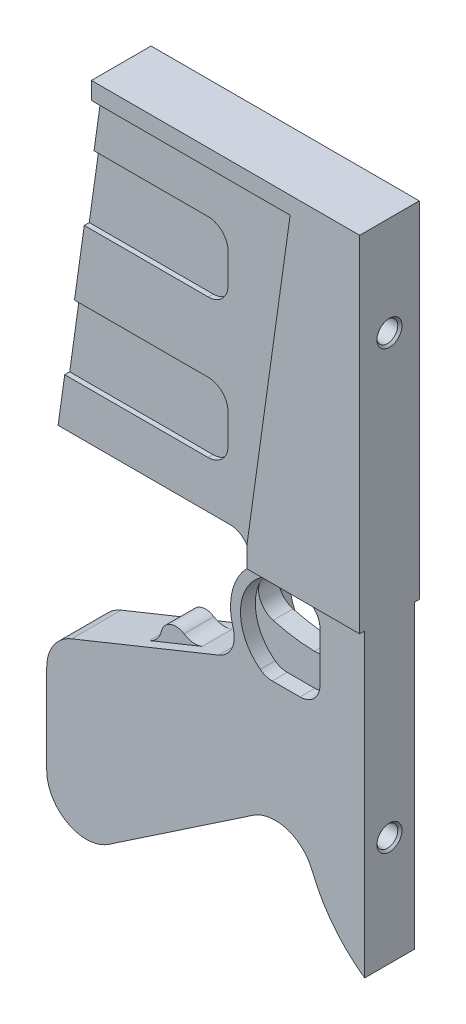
from build123d import *

# Parameters (mm, degrees)
EXTRUDE_5_DEPTH              = 6
EXTRUDE_6_DEPTH              = 4
EXTRUDE_8_DEPTH              = 3
EXTRUDE_11_DEPTH             = 5
EXTRUDE_12_DEPTH             = 3
EXTRUDE_13_DEPTH             = 2
HOLE_WIZARD_M5_1_D           = 4.2
HOLE_WIZARD_M5_1_DEPTH       = 12
HOLE_WIZARD_M5_1_CSINK_D     = 5.05
HOLE_WIZARD_M5_1_CSINK_ANGLE = 90
HOLE_WIZARD_M5_1_TIP         = 1.2618073


with BuildPart() as part:
    # Sketch 1 → Extrude 5 (new, symmetric)
    with BuildSketch(Plane.XY):
        Polygon((-9, 60.5), (0, 60.5), (0, 130), (-54, 130), (-54, 126.5), (-14, 126.5), (-22.714732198, 64.491458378), (-22.714732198, 60.5), align=None)
    extrude(amount=EXTRUDE_5_DEPTH, both=True)

    # Sketch 1_5 → Extrude 6 (add, symmetric)
    with BuildSketch(Plane.XY):
        with BuildLine():
            Line((-24.090454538, 60.5), (-22.714732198, 60.5))
            Line((-22.714732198, 60.5), (-22.714732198, 64.491458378))
            Line((-22.714732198, 64.491458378), (-14, 126.5))
            Line((-14, 126.5), (-54, 126.5))
            Line((-54, 126.5), (-55.475678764, 116))
            Line((-55.475678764, 116), (-32.5, 116))
            ThreePointArc((-32.5, 116), (-29.671572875, 114.828427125), (-28.5, 112))
            Line((-28.5, 112), (-28.5, 106))
            ThreePointArc((-28.5, 106), (-29.671572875, 103.171572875), (-32.5, 102))
            Line((-32.5, 102), (-57.44325045, 102))
            Line((-57.44325045, 102), (-59.410822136, 88))
            Line((-59.410822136, 88), (-32.5, 88))
            ThreePointArc((-32.5, 88), (-29.671572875, 86.828427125), (-28.5, 84))
            Line((-28.5, 84), (-28.5, 78))
            ThreePointArc((-28.5, 78), (-29.671572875, 75.171572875), (-32.5, 74))
            Line((-32.5, 74), (-61.378393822, 74))
            Line((-61.378393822, 74), (-62.713531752, 64.5))
            Line((-62.713531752, 64.5), (-28.090454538, 64.5))
            ThreePointArc((-28.090454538, 64.5), (-25.262027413, 63.328427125), (-24.090454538, 60.5))
        make_face()
    extrude(amount=EXTRUDE_6_DEPTH, both=True)

    # Sketch 1_7 → Extrude 8 (add, symmetric)
    with BuildSketch(Plane.XY):
        with BuildLine():
            Line((-32.5, 116), (-55.475678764, 116))
            Line((-55.475678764, 116), (-57.44325045, 102))
            Line((-57.44325045, 102), (-32.5, 102))
            ThreePointArc((-32.5, 102), (-29.671572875, 103.171572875), (-28.5, 106))
            Line((-28.5, 106), (-28.5, 112))
            ThreePointArc((-28.5, 112), (-29.671572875, 114.828427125), (-32.5, 116))
        make_face()
        with BuildLine():
            Line((-59.410822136, 88), (-61.378393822, 74))
            Line((-61.378393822, 74), (-32.5, 74))
            ThreePointArc((-32.5, 74), (-29.671572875, 75.171572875), (-28.5, 78))
            Line((-28.5, 78), (-28.5, 84))
            ThreePointArc((-28.5, 84), (-29.671572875, 86.828427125), (-32.5, 88))
            Line((-32.5, 88), (-59.410822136, 88))
        make_face()
    extrude(amount=EXTRUDE_8_DEPTH, both=True)

    # Sketch 1_11 → Extrude 11 (add, symmetric)
    with BuildSketch(Plane.XY):
        with BuildLine():
            ThreePointArc((-10.561600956, 13.444523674), (-6.258819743, 5.953960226), (0, 0))
            Line((0, 0), (0, 60.5))
            Line((0, 60.5), (-9, 60.5))
            Line((-9, 60.5), (-22.714732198, 60.5))
            Line((-22.714732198, 60.5), (-22.714732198, 60.491458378))
            ThreePointArc((-22.714732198, 60.491458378), (-23.840841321, 59.414155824), (-24.817840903, 58.2))
            ThreePointArc((-24.817840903, 58.2), (-26.853536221, 53.169138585), (-26.4647206, 47.755965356))
            ThreePointArc((-26.4647206, 47.755965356), (-26.726961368, 44.112432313), (-29.385728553, 41.607425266))
            Line((-29.385728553, 41.607425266), (-34.673734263, 39.470932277))
            Line((-34.673734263, 39.470932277), (-45.326265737, 35.16703019))
            Line((-45.326265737, 35.16703019), (-58.996852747, 29.643754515))
            ThreePointArc((-58.996852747, 29.643754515), (-62.63230058, 26.699826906), (-64, 22.226283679))
            Line((-64, 22.226283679), (-64, 4.168163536))
            ThreePointArc((-64, 4.168163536), (-59.755772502, -2.895417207), (-51.526456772, -2.464137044))
            Line((-51.526456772, -2.464137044), (-22.473543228, 17.13230058))
            ThreePointArc((-22.473543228, 17.13230058), (-15.634092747, 18.142151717), (-10.561600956, 13.444523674))
        make_face()
        with BuildLine():
            ThreePointArc((-13, 60.491458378), (-10.171572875, 59.319885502), (-9, 56.491458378))
            Line((-9, 56.491458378), (-9, 52.91306727))
            Line((-9, 52.91306727), (-9, 46.5))
            ThreePointArc((-9, 46.5), (-10.171572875, 43.671572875), (-13, 42.5))
            Line((-13, 42.5), (-18.6, 42.5))
            ThreePointArc((-18.6, 42.5), (-19.864911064, 42.705266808), (-21, 43.3))
            ThreePointArc((-21, 43.3), (-24.739823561, 49.033761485), (-23.915341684, 55.829534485))
            ThreePointArc((-23.915341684, 55.829534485), (-22.263119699, 58.173652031), (-20.013526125, 59.952430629))
            ThreePointArc((-20.013526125, 59.952430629), (-19.046410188, 60.354351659), (-18.008115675, 60.491458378))
            Line((-18.008115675, 60.491458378), (-13, 60.491458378))
        make_face(mode=Mode.SUBTRACT)
    extrude(amount=EXTRUDE_11_DEPTH, both=True)

    # Sketch 1_12 → Extrude 12 (add, symmetric)
    with BuildSketch(Plane.XY):
        with BuildLine():
            ThreePointArc((-42.924868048, 37.986174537), (-43.779668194, 36.281959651), (-45.326265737, 35.16703019))
            Line((-45.326265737, 35.16703019), (-34.673734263, 39.470932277))
            ThreePointArc((-34.673734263, 39.470932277), (-36.560758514, 39.198588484), (-38.359497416, 39.830704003))
            ThreePointArc((-38.359497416, 39.830704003), (-41.12381978, 40.100532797), (-42.924868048, 37.986174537))
        make_face()
    extrude(amount=EXTRUDE_12_DEPTH, both=True)

    # Sketch 1_13 → Extrude 13 (add, symmetric)
    with BuildSketch(Plane.XY):
        with BuildLine():
            Line((-9, 46.5), (-9, 52.91306727))
            ThreePointArc((-9, 52.91306727), (-10.212933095, 50.043876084), (-13.116129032, 48.91475337))
            ThreePointArc((-13.116129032, 48.91475337), (-17.302383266, 49.28879938), (-21.41361856, 50.161942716))
            ThreePointArc((-21.41361856, 50.161942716), (-24.008562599, 52.402449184), (-23.915341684, 55.829534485))
            ThreePointArc((-23.915341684, 55.829534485), (-24.739823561, 49.033761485), (-21, 43.3))
            ThreePointArc((-21, 43.3), (-19.864911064, 42.705266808), (-18.6, 42.5))
            Line((-18.6, 42.5), (-13, 42.5))
            ThreePointArc((-13, 42.5), (-10.171572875, 43.671572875), (-9, 46.5))
        make_face()
    extrude(amount=EXTRUDE_13_DEPTH, both=True)

    # Hole Wizard M5 _1
    with Locations(Plane(origin=(0, 0, 0), x_dir=(0, 0, -1), z_dir=(1, 0, 0))):
        with Locations((0, 110), (0, 22)):
            CounterSinkHole(HOLE_WIZARD_M5_1_D / 2, HOLE_WIZARD_M5_1_CSINK_D / 2, depth=HOLE_WIZARD_M5_1_DEPTH, counter_sink_angle=HOLE_WIZARD_M5_1_CSINK_ANGLE)
            with Locations((0, 0, -(HOLE_WIZARD_M5_1_DEPTH + HOLE_WIZARD_M5_1_TIP / 2))):  # 118° drill point
                Cone(0, HOLE_WIZARD_M5_1_D / 2, HOLE_WIZARD_M5_1_TIP, mode=Mode.SUBTRACT)


solid = part.part
